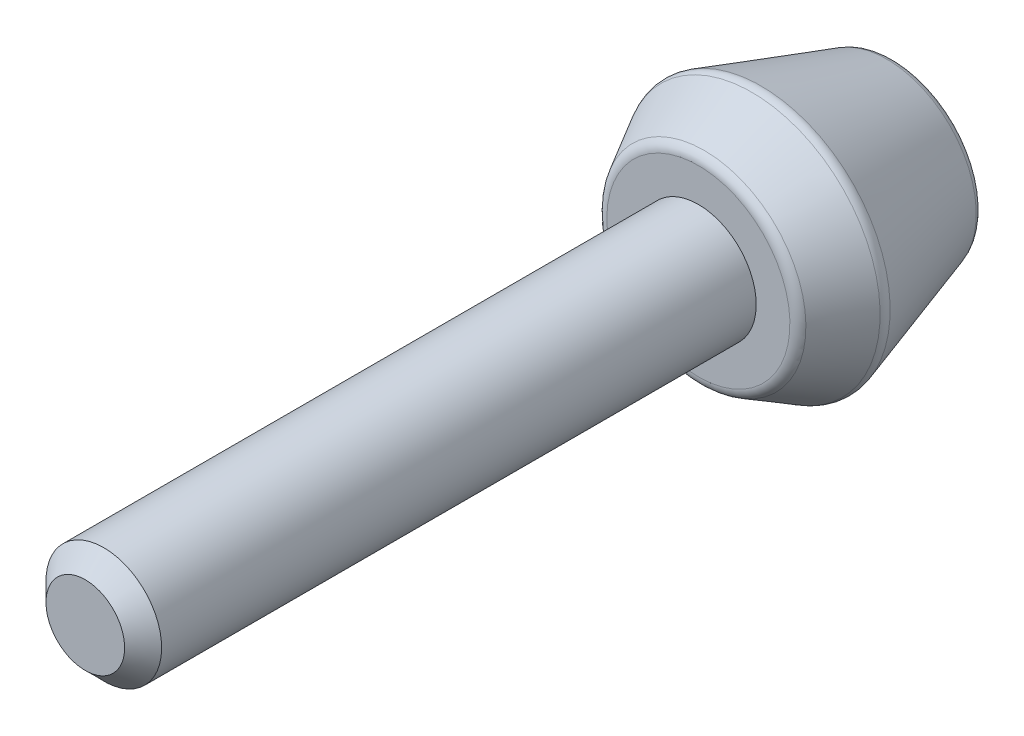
ISO-10303-21;
HEADER;
FILE_DESCRIPTION(('STEP AP214'),'2;1');
FILE_NAME('part.step','',(''),(''),'','','');
FILE_SCHEMA(('AUTOMOTIVE_DESIGN { 1 0 10303 214 1 1 1 1 }'));
ENDSEC;
DATA;
#1=APPLICATION_CONTEXT('core data for automotive mechanical design processes');
#2=APPLICATION_PROTOCOL_DEFINITION('international standard','automotive_design',2000,#1);
#3=PRODUCT_CONTEXT('',#1,'mechanical');
#4=PRODUCT('Part','Part','',(#3));
#5=PRODUCT_RELATED_PRODUCT_CATEGORY('part','',(#4));
#6=PRODUCT_DEFINITION_FORMATION('','',#4);
#7=PRODUCT_DEFINITION_CONTEXT('part definition',#1,'design');
#8=PRODUCT_DEFINITION('design','',#6,#7);
#9=PRODUCT_DEFINITION_SHAPE('','',#8);
#10=(LENGTH_UNIT() NAMED_UNIT(*) SI_UNIT(.MILLI.,.METRE.));
#11=(NAMED_UNIT(*) PLANE_ANGLE_UNIT() SI_UNIT($,.RADIAN.));
#12=(NAMED_UNIT(*) SI_UNIT($,.STERADIAN.) SOLID_ANGLE_UNIT());
#13=UNCERTAINTY_MEASURE_WITH_UNIT(LENGTH_MEASURE(1.E-05),#10,'distance_accuracy_value','');
#14=(GEOMETRIC_REPRESENTATION_CONTEXT(3) GLOBAL_UNCERTAINTY_ASSIGNED_CONTEXT((#13)) GLOBAL_UNIT_ASSIGNED_CONTEXT((#10,
#11,#12)) REPRESENTATION_CONTEXT('',''));
#15=CARTESIAN_POINT('',(0.,0.,0.));
#16=DIRECTION('',(0.,0.,1.));
#17=DIRECTION('',(1.,0.,0.));
#18=AXIS2_PLACEMENT_3D('',#15,#16,#17);
#19=CARTESIAN_POINT('',(0.,0.,8.));
#20=DIRECTION('',(0.,0.,-1.));
#21=DIRECTION('',(0.769107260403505,-0.639119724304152,0.));
#22=AXIS2_PLACEMENT_3D('',#19,#20,#21);
#23=TOROIDAL_SURFACE('',#22,3.95693804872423,0.5);
#24=CARTESIAN_POINT('',(0.,0.,8.24430168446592));
#25=DIRECTION('',(0.,0.,-1.));
#26=DIRECTION('',(0.769107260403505,-0.639119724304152,0.));
#27=AXIS2_PLACEMENT_3D('',#24,#25,#26);
#28=CIRCLE('',#27,4.39319105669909);
#29=CARTESIAN_POINT('',(3.37883513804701,-2.807775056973,8.24430168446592));
#30=VERTEX_POINT('',#29);
#31=EDGE_CURVE('E30',#30,#30,#28,.T.);
#32=ORIENTED_EDGE('',*,*,#31,.F.);
#33=EDGE_LOOP('',(#32));
#34=FACE_BOUND('',#33,.T.);
#35=CARTESIAN_POINT('',(0.,0.,8.5));
#36=DIRECTION('',(0.,0.,1.));
#37=DIRECTION('',(0.769107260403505,-0.639119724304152,0.));
#38=AXIS2_PLACEMENT_3D('',#35,#36,#37);
#39=CIRCLE('',#38,3.95693804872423);
#40=CARTESIAN_POINT('',(3.04330978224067,-2.52895715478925,8.5));
#41=VERTEX_POINT('',#40);
#42=EDGE_CURVE('E42',#41,#41,#39,.T.);
#43=ORIENTED_EDGE('',*,*,#42,.F.);
#44=EDGE_LOOP('',(#43));
#45=FACE_BOUND('',#44,.T.);
#46=ADVANCED_FACE('F15',(#34,#45),#23,.T.);
#47=CARTESIAN_POINT('',(0.,0.,5.94457264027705));
#48=DIRECTION('',(0.,0.,1.));
#49=DIRECTION('',(-0.769107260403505,0.639119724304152,0.));
#50=AXIS2_PLACEMENT_3D('',#47,#48,#49);
#51=TOROIDAL_SURFACE('',#50,5.10797737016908,0.5);
#52=CARTESIAN_POINT('',(0.,0.,6.18887432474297));
#53=DIRECTION('',(0.,0.,1.));
#54=DIRECTION('',(-0.769107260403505,0.639119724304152,0.));
#55=AXIS2_PLACEMENT_3D('',#52,#53,#54);
#56=CIRCLE('',#55,5.54423037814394);
#57=CARTESIAN_POINT('',(-4.26410783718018,3.54342699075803,6.18887432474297));
#58=VERTEX_POINT('',#57);
#59=EDGE_CURVE('E36',#58,#58,#56,.T.);
#60=ORIENTED_EDGE('',*,*,#59,.F.);
#61=EDGE_LOOP('',(#60));
#62=FACE_BOUND('',#61,.T.);
#63=CARTESIAN_POINT('',(0.,0.,5.79362678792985));
#64=DIRECTION('',(0.,0.,-1.));
#65=DIRECTION('',(0.769107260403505,-0.639119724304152,0.));
#66=AXIS2_PLACEMENT_3D('',#63,#64,#65);
#67=CIRCLE('',#66,5.58464848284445);
#68=CARTESIAN_POINT('',(4.29519369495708,-3.56925899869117,5.79362678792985));
#69=VERTEX_POINT('',#68);
#70=EDGE_CURVE('E41',#69,#69,#67,.T.);
#71=ORIENTED_EDGE('',*,*,#70,.F.);
#72=EDGE_LOOP('',(#71));
#73=FACE_BOUND('',#72,.T.);
#74=ADVANCED_FACE('F62',(#62,#73),#51,.T.);
#75=CARTESIAN_POINT('',(0.,0.,0.5));
#76=DIRECTION('',(0.,0.,-1.));
#77=DIRECTION('',(0.769107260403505,-0.639119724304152,0.));
#78=AXIS2_PLACEMENT_3D('',#75,#76,#77);
#79=TOROIDAL_SURFACE('',#78,3.38386270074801,0.5);
#80=CARTESIAN_POINT('',(0.,0.,0.));
#81=DIRECTION('',(0.,0.,-1.));
#82=DIRECTION('',(0.769107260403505,-0.639119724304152,0.));
#83=AXIS2_PLACEMENT_3D('',#80,#81,#82);
#84=CIRCLE('',#83,3.38386270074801);
#85=CARTESIAN_POINT('',(2.60255337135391,-2.16269339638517,0.));
#86=VERTEX_POINT('',#85);
#87=EDGE_CURVE('E37',#86,#86,#84,.T.);
#88=ORIENTED_EDGE('',*,*,#87,.F.);
#89=EDGE_LOOP('',(#88));
#90=FACE_BOUND('',#89,.T.);
#91=CARTESIAN_POINT('',(0.,0.,0.3490541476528));
#92=DIRECTION('',(0.,0.,1.));
#93=DIRECTION('',(0.769107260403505,-0.639119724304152,0.));
#94=AXIS2_PLACEMENT_3D('',#91,#92,#93);
#95=CIRCLE('',#94,3.86053381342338);
#96=CARTESIAN_POINT('',(2.96916458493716,-2.46734330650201,0.349054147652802));
#97=VERTEX_POINT('',#96);
#98=EDGE_CURVE('E46',#97,#97,#95,.T.);
#99=ORIENTED_EDGE('',*,*,#98,.F.);
#100=EDGE_LOOP('',(#99));
#101=FACE_BOUND('',#100,.T.);
#102=ADVANCED_FACE('F65',(#90,#101),#79,.T.);
#103=CARTESIAN_POINT('',(0.,0.,8.5));
#104=DIRECTION('',(0.,0.,-1.));
#105=DIRECTION('',(0.769107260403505,-0.639119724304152,0.));
#106=AXIS2_PLACEMENT_3D('',#103,#104,#105);
#107=CONICAL_SURFACE('',#106,4.25,0.510488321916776);
#108=ORIENTED_EDGE('',*,*,#59,.T.);
#109=EDGE_LOOP('',(#108));
#110=FACE_BOUND('',#109,.T.);
#111=ORIENTED_EDGE('',*,*,#31,.T.);
#112=EDGE_LOOP('',(#111));
#113=FACE_BOUND('',#112,.T.);
#114=ADVANCED_FACE('F59',(#110,#113),#107,.T.);
#115=CARTESIAN_POINT('',(0.,0.,0.));
#116=DIRECTION('',(0.,0.,1.));
#117=DIRECTION('',(-0.769107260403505,0.639119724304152,0.));
#118=AXIS2_PLACEMENT_3D('',#115,#116,#117);
#119=CONICAL_SURFACE('',#118,3.75,0.306676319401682);
#120=ORIENTED_EDGE('',*,*,#70,.T.);
#121=EDGE_LOOP('',(#120));
#122=FACE_BOUND('',#121,.T.);
#123=ORIENTED_EDGE('',*,*,#98,.T.);
#124=EDGE_LOOP('',(#123));
#125=FACE_BOUND('',#124,.T.);
#126=ADVANCED_FACE('F69',(#122,#125),#119,.T.);
#127=CARTESIAN_POINT('',(0.,0.,0.));
#128=DIRECTION('',(0.,0.,-1.));
#129=DIRECTION('',(0.769107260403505,-0.639119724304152,0.));
#130=AXIS2_PLACEMENT_3D('',#127,#128,#129);
#131=PLANE('',#130);
#132=ORIENTED_EDGE('',*,*,#87,.T.);
#133=EDGE_LOOP('',(#132));
#134=FACE_BOUND('',#133,.T.);
#135=ADVANCED_FACE('F72',(#134),#131,.T.);
#136=CARTESIAN_POINT('',(0.,0.,8.5));
#137=DIRECTION('',(0.,0.,-1.));
#138=DIRECTION('',(0.769107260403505,-0.639119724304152,0.));
#139=AXIS2_PLACEMENT_3D('',#136,#137,#138);
#140=PLANE('',#139);
#141=CARTESIAN_POINT('',(0.,0.,8.5));
#142=DIRECTION('',(0.,0.,-1.));
#143=DIRECTION('',(0.,1.,0.));
#144=AXIS2_PLACEMENT_3D('',#141,#142,#143);
#145=CIRCLE('',#144,2.5);
#146=CARTESIAN_POINT('',(0.,2.49999999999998,8.5));
#147=VERTEX_POINT('',#146);
#148=EDGE_CURVE('E26',#147,#147,#145,.F.);
#149=ORIENTED_EDGE('',*,*,#148,.F.);
#150=EDGE_LOOP('',(#149));
#151=FACE_BOUND('',#150,.T.);
#152=ORIENTED_EDGE('',*,*,#42,.T.);
#153=EDGE_LOOP('',(#152));
#154=FACE_BOUND('',#153,.T.);
#155=ADVANCED_FACE('F89',(#151,#154),#140,.F.);
#156=CARTESIAN_POINT('',(0.,0.,35.));
#157=DIRECTION('',(0.,0.,-1.));
#158=DIRECTION('',(0.692363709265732,-0.721548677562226,0.));
#159=AXIS2_PLACEMENT_3D('',#156,#157,#158);
#160=PLANE('',#159);
#161=CARTESIAN_POINT('',(0.,0.,35.));
#162=DIRECTION('',(0.,0.,-1.));
#163=DIRECTION('',(0.,1.,0.));
#164=AXIS2_PLACEMENT_3D('',#161,#162,#163);
#165=CIRCLE('',#164,1.70000000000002);
#166=CARTESIAN_POINT('',(0.,1.70000000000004,35.));
#167=VERTEX_POINT('',#166);
#168=EDGE_CURVE('E10',#167,#167,#165,.F.);
#169=ORIENTED_EDGE('',*,*,#168,.T.);
#170=EDGE_LOOP('',(#169));
#171=FACE_BOUND('',#170,.T.);
#172=ADVANCED_FACE('F86',(#171),#160,.F.);
#173=CARTESIAN_POINT('',(0.,0.,2.));
#174=DIRECTION('',(0.,0.,1.));
#175=DIRECTION('',(-0.692363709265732,0.721548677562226,0.));
#176=AXIS2_PLACEMENT_3D('',#173,#174,#175);
#177=CYLINDRICAL_SURFACE('',#176,2.5);
#178=CARTESIAN_POINT('',(0.,0.,34.2));
#179=DIRECTION('',(0.,0.,-1.));
#180=DIRECTION('',(0.,1.,0.));
#181=AXIS2_PLACEMENT_3D('',#178,#179,#180);
#182=CIRCLE('',#181,2.5);
#183=CARTESIAN_POINT('',(0.,2.50000000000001,34.2));
#184=VERTEX_POINT('',#183);
#185=EDGE_CURVE('E22',#184,#184,#182,.T.);
#186=ORIENTED_EDGE('',*,*,#185,.T.);
#187=EDGE_LOOP('',(#186));
#188=FACE_BOUND('',#187,.T.);
#189=ORIENTED_EDGE('',*,*,#148,.T.);
#190=EDGE_LOOP('',(#189));
#191=FACE_BOUND('',#190,.T.);
#192=ADVANCED_FACE('F88',(#188,#191),#177,.T.);
#193=CARTESIAN_POINT('',(0.,0.,34.2));
#194=DIRECTION('',(0.,0.,-1.));
#195=DIRECTION('',(0.,1.,0.));
#196=AXIS2_PLACEMENT_3D('',#193,#194,#195);
#197=CONICAL_SURFACE('',#196,2.5,0.785398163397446);
#198=ORIENTED_EDGE('',*,*,#168,.F.);
#199=EDGE_LOOP('',(#198));
#200=FACE_BOUND('',#199,.T.);
#201=ORIENTED_EDGE('',*,*,#185,.F.);
#202=EDGE_LOOP('',(#201));
#203=FACE_BOUND('',#202,.T.);
#204=ADVANCED_FACE('F17',(#200,#203),#197,.T.);
#205=CLOSED_SHELL('',(#46,#74,#102,#114,#126,#135,#155,#172,#192,#204));
#206=MANIFOLD_SOLID_BREP('B1',#205);
#207=ADVANCED_BREP_SHAPE_REPRESENTATION('',(#18,#206),#14);
#208=SHAPE_DEFINITION_REPRESENTATION(#9,#207);
ENDSEC;
END-ISO-10303-21;
